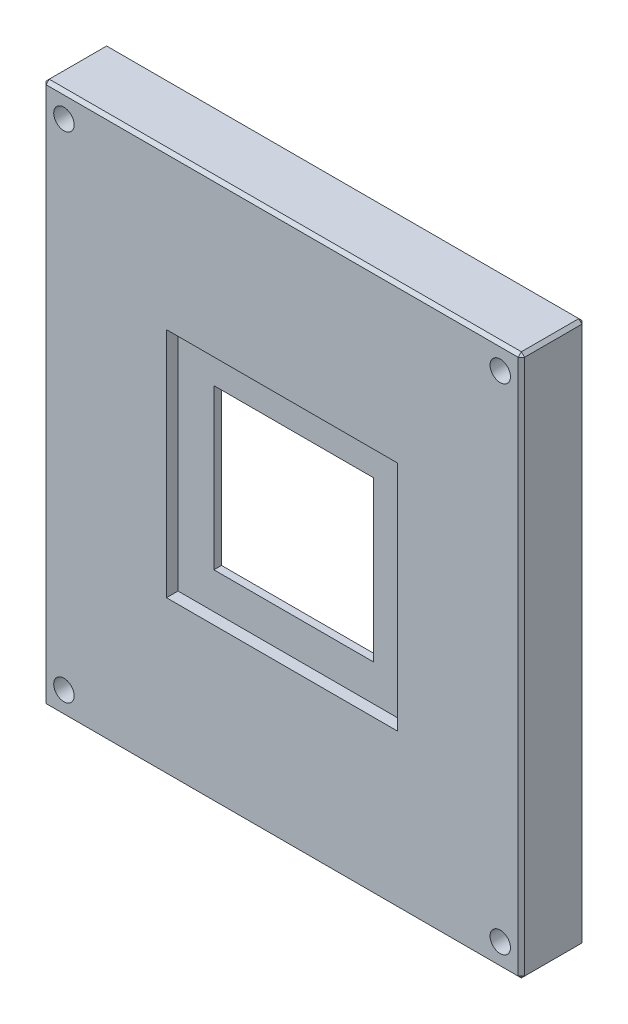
from build123d import *

# Parameters (mm, degrees)
SKETCH1_W                     = 75
SKETCH1_H                     = 85
SKETCH1_W_2                   = 25
SKETCH1_H_2                   = 25
MAIN_BODY_DEPTH               = 10
SKETCH2_W                     = 36.24
SKETCH2_H                     = 36.39
LC_SHUTTER_RECESS_DEPTH       = 1.81
CHAMFER2_SIZE                 = 7
SKETCH3_R                     = 2.8
M4_THREADED_INSERT_HOLE_DEPTH = 10
SKETCH4_R                     = 1.6
M2_THREADED_INSERT_HOLE_DEPTH = 58.554322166
MIRROR2_COPY_1_SKETCH_R       = 1.6
MIRROR2_COPY_1_DEPTH          = 58.554322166
CHAMFER3_SIZE                 = 0.5


with BuildPart() as part:
    # Sketch1 → main_body (new body)
    with BuildSketch(Plane.XY):
        Rectangle(SKETCH1_W, SKETCH1_H)
        Rectangle(SKETCH1_W_2, SKETCH1_H_2, mode=Mode.SUBTRACT)
    extrude(amount=MAIN_BODY_DEPTH)

    # Sketch2 → LC_shutter_recess (cut)
    with BuildSketch(Plane.XY.offset(10)):
        Rectangle(SKETCH2_W, SKETCH2_H)
    extrude(amount=-LC_SHUTTER_RECESS_DEPTH, mode=Mode.SUBTRACT)

    # Chamfer2
    chamfer2_edges = [part.edges().sort_by_distance(p)[0] for p in [
        (12.5, 0, 0),
        (0, 12.5, 0),
        (-12.5, 0, 0),
        (0, -12.5, 0),
    ]]
    chamfer(chamfer2_edges, length=CHAMFER2_SIZE)

    # Sketch3 → M4_threaded_insert_hole (cut)
    with BuildSketch(Plane.XZ.offset(42.5)):
        with Locations(Location((0, 5, 0), (0, 0, 270))):
            Circle(SKETCH3_R)
    extrude(amount=-M4_THREADED_INSERT_HOLE_DEPTH, mode=Mode.SUBTRACT)

    # Sketch4 → M2_threaded_insert_hole (cut, through all)
    with BuildSketch(Plane.XY.offset(10)):
        with Locations((-34.191891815, 38.750810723)):
            Circle(SKETCH4_R)
    m2_threaded_insert_hole = extrude(amount=-M2_THREADED_INSERT_HOLE_DEPTH, mode=Mode.SUBTRACT)

    # Mirror1: M2_threaded_insert_hole across plane
    add(m2_threaded_insert_hole.mirror(Plane.ZX), mode=Mode.SUBTRACT)

    # Mirror2: M2_threaded_insert_hole across plane
    add(m2_threaded_insert_hole.mirror(Plane(origin=(0, 0, 0), x_dir=(0, 0, 1), z_dir=(1, 0, 0))), mode=Mode.SUBTRACT)

    # Mirror2 copy 1 sketch → Mirror2 copy 1 (cut, through all)
    with BuildSketch(Plane(origin=(0, 0, 10), x_dir=(-1, 0, 0), z_dir=(0, 0, 1))):
        with Locations((-34.191891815, 38.750810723)):
            Circle(MIRROR2_COPY_1_SKETCH_R)
    extrude(amount=-MIRROR2_COPY_1_DEPTH, mode=Mode.SUBTRACT)

    # Chamfer3
    chamfer3_edges = [part.edges().sort_by_distance(p)[0] for p in [
        (-37.5, 0, 10),
        (0, -42.5, 10),
        (37.5, 0, 10),
        (0, -42.5, 0),
        (-37.5, 0, 0),
        (0, 42.5, 0),
        (37.5, 0, 0),
        (37.5, -42.5, 5),
        (-37.5, -42.5, 5),
        (-37.5, 42.5, 5),
        (37.5, 42.5, 5),
        (0, 42.5, 10),
    ]]
    chamfer(chamfer3_edges, length=CHAMFER3_SIZE)


solid = part.part
